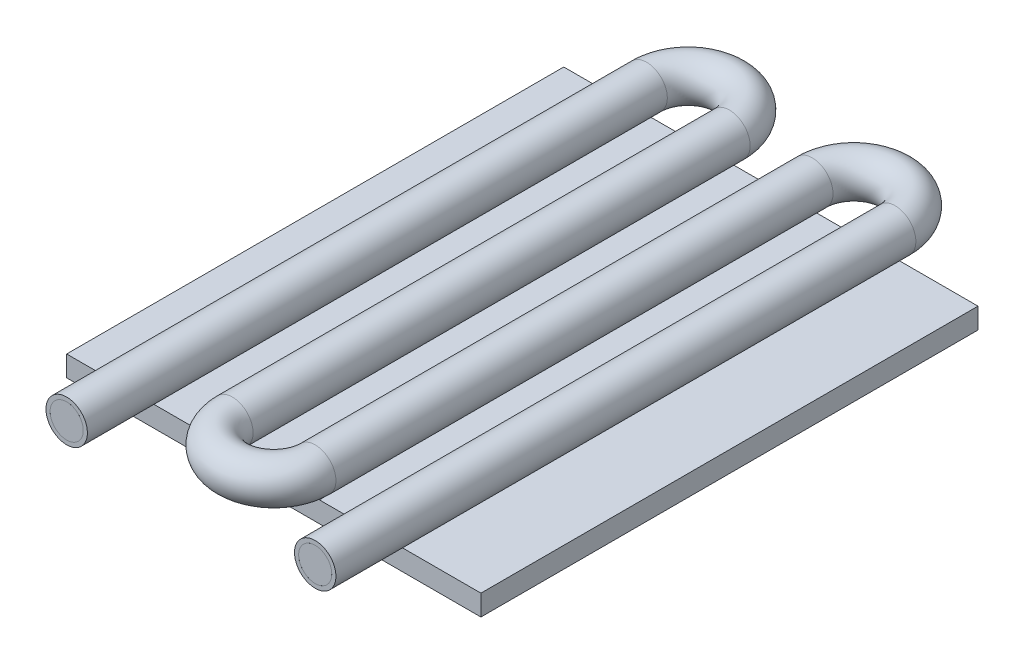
from build123d import *

# Parameters (mm, degrees)
SKETCH1_W               = 200
SKETCH1_H               = 240
BOSS_EXTRUDE1_DEPTH     = 10
SWEEP_THIN1_PROFILE_R   = 10
SWEEP_THIN1_PROFILE_R_2 = 8
SKETCH21_W              = 4
SKETCH21_H              = 2.8
BOSS_EXTRUDE2_DEPTH     = 240
SKETCH24_W              = 4
SKETCH24_H              = 2.8
BOSS_EXTRUDE3_DEPTH     = 240
SKETCH25_W              = 4
SKETCH25_H              = 2.8
BOSS_EXTRUDE4_DEPTH     = 240
SKETCH26_R              = 8
LID1_DEPTH              = 5
SKETCH28_R              = 8
LID2_DEPTH              = 5


with BuildPart() as part:
    # Sketch1 → Boss-Extrude1 (new body)
    with BuildSketch(Plane(origin=(0, 0, 0), x_dir=(1, 0, 0), z_dir=(0, 1, 0))):
        Rectangle(SKETCH1_W, SKETCH1_H)
    extrude(amount=BOSS_EXTRUDE1_DEPTH)



with BuildPart() as body_2:
    # Sweep-Thin1: sweep along a path in Sketch3
    with BuildLine(Plane(origin=(0, 22, 0), x_dir=(1, 0, 0), z_dir=(0, 1, 0))) as sweep_thin1_path:
        Line((-60, -160), (-60, 120))
        ThreePointArc((-60, 120), (-40, 140), (-20, 120))
        Line((-20, 120), (-20, -120))
        ThreePointArc((-20, -120), (0, -140), (20, -120))
        Line((20, -120), (20, 120))
        ThreePointArc((20, 120), (40, 140), (60, 120))
        Line((60, 120), (60, -160))
    # Sweep-Thin1 profile (on start of the path) → Sweep-Thin1 (sweep)
    with BuildSketch(Plane(origin=(-60, 22, 160), x_dir=(-1, 0, 0), z_dir=(0, 0, -1))):
        Circle(SWEEP_THIN1_PROFILE_R)
        Circle(SWEEP_THIN1_PROFILE_R_2, mode=Mode.SUBTRACT)
    sweep(path=sweep_thin1_path.line)


with BuildPart() as part_1:
    add(part.part)

    add(body_2.part)  # Boss-Extrude2 merges body 2
    # Sketch21 → Boss-Extrude2 (add)
    with BuildSketch(Plane.XY.offset(120)):
        with Locations((-60, 11.4)):
            Rectangle(SKETCH21_W, SKETCH21_H)
    extrude(amount=-BOSS_EXTRUDE2_DEPTH)

    # Sketch24 → Boss-Extrude3 (add)
    with BuildSketch(Plane(origin=(0, 0, -120), x_dir=(-1, 0, 0), z_dir=(0, 0, -1))):
        with Locations((-60, 11.4)):
            Rectangle(SKETCH24_W, SKETCH24_H)
    extrude(amount=-BOSS_EXTRUDE3_DEPTH)

    # Sketch25 → Boss-Extrude4 (add)
    with BuildSketch(Plane.XY.offset(120)):
        with Locations((-20, 11.4)):
            Rectangle(SKETCH25_W, SKETCH25_H)
        with Locations((20, 11.4)):
            Rectangle(SKETCH25_W, SKETCH25_H)
    extrude(amount=-BOSS_EXTRUDE4_DEPTH)


with BuildPart() as body_2_2:
    # Sketch26 → Lid1 (new body)
    with BuildSketch(Plane.XY.offset(160)):
        with Locations((-60, 22)):
            Circle(SKETCH26_R)
    extrude(amount=-LID1_DEPTH)


with BuildPart() as body_3:
    # Sketch28 → Lid2 (new body)
    with BuildSketch(Plane.XY.offset(160)):
        with Locations((60, 22)):
            Circle(SKETCH28_R)
    extrude(amount=-LID2_DEPTH)


solid = Compound([part_1.part, body_2_2.part, body_3.part])
